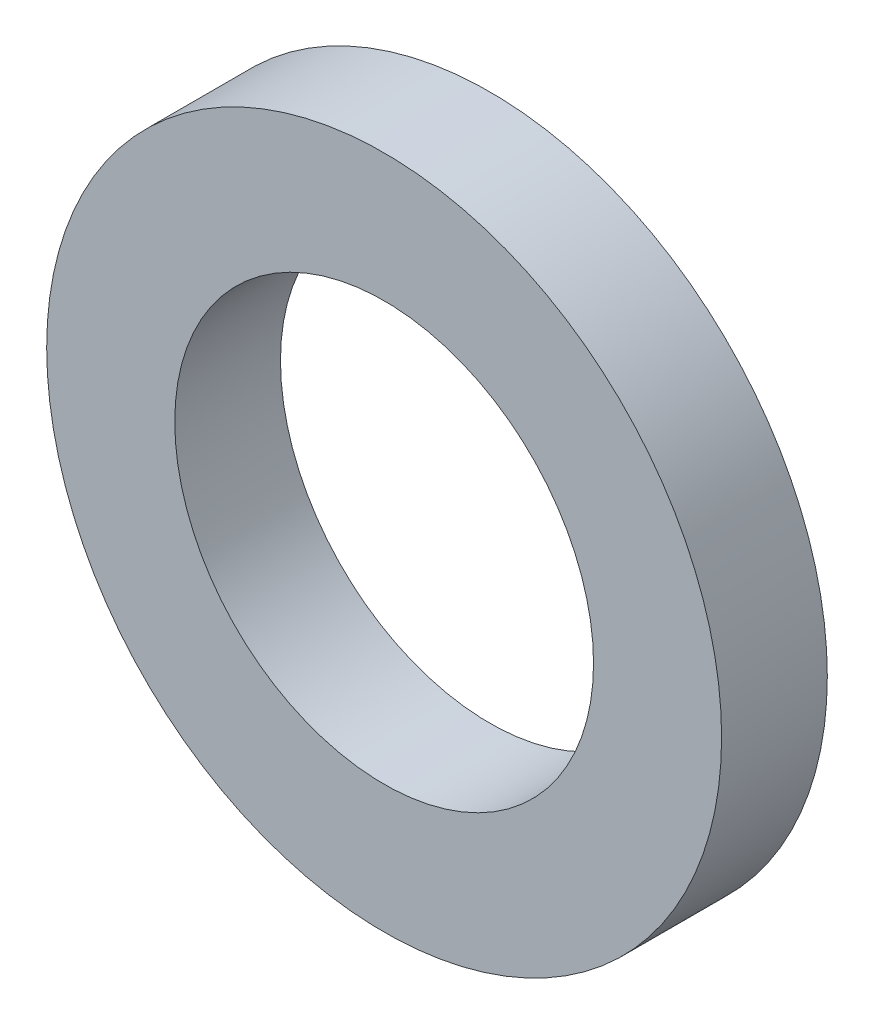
ISO-10303-21;
HEADER;
FILE_DESCRIPTION(('STEP AP214'),'2;1');
FILE_NAME('part.step','',(''),(''),'','','');
FILE_SCHEMA(('AUTOMOTIVE_DESIGN { 1 0 10303 214 1 1 1 1 }'));
ENDSEC;
DATA;
#1=APPLICATION_CONTEXT('core data for automotive mechanical design processes');
#2=APPLICATION_PROTOCOL_DEFINITION('international standard','automotive_design',2000,#1);
#3=PRODUCT_CONTEXT('',#1,'mechanical');
#4=PRODUCT('Part','Part','',(#3));
#5=PRODUCT_RELATED_PRODUCT_CATEGORY('part','',(#4));
#6=PRODUCT_DEFINITION_FORMATION('','',#4);
#7=PRODUCT_DEFINITION_CONTEXT('part definition',#1,'design');
#8=PRODUCT_DEFINITION('design','',#6,#7);
#9=PRODUCT_DEFINITION_SHAPE('','',#8);
#10=(LENGTH_UNIT() NAMED_UNIT(*) SI_UNIT(.MILLI.,.METRE.));
#11=(NAMED_UNIT(*) PLANE_ANGLE_UNIT() SI_UNIT($,.RADIAN.));
#12=(NAMED_UNIT(*) SI_UNIT($,.STERADIAN.) SOLID_ANGLE_UNIT());
#13=UNCERTAINTY_MEASURE_WITH_UNIT(LENGTH_MEASURE(1.E-05),#10,'distance_accuracy_value','');
#14=(GEOMETRIC_REPRESENTATION_CONTEXT(3) GLOBAL_UNCERTAINTY_ASSIGNED_CONTEXT((#13)) GLOBAL_UNIT_ASSIGNED_CONTEXT((#10,
#11,#12)) REPRESENTATION_CONTEXT('',''));
#15=CARTESIAN_POINT('',(0.,0.,0.));
#16=DIRECTION('',(0.,0.,1.));
#17=DIRECTION('',(1.,0.,0.));
#18=AXIS2_PLACEMENT_3D('',#15,#16,#17);
#19=CARTESIAN_POINT('',(0.,0.,2.6));
#20=DIRECTION('',(0.,0.,1.));
#21=DIRECTION('',(1.,0.,0.));
#22=AXIS2_PLACEMENT_3D('',#19,#20,#21);
#23=PLANE('',#22);
#24=CARTESIAN_POINT('',(0.,0.,2.6));
#25=DIRECTION('',(0.,0.,1.));
#26=DIRECTION('',(1.,0.,0.));
#27=AXIS2_PLACEMENT_3D('',#24,#25,#26);
#28=CIRCLE('',#27,8.3);
#29=CARTESIAN_POINT('',(8.3,0.,2.6));
#30=VERTEX_POINT('',#29);
#31=EDGE_CURVE('E10',#30,#30,#28,.T.);
#32=ORIENTED_EDGE('',*,*,#31,.T.);
#33=EDGE_LOOP('',(#32));
#34=FACE_BOUND('',#33,.T.);
#35=CARTESIAN_POINT('',(0.,0.,2.6));
#36=DIRECTION('',(0.,0.,1.));
#37=DIRECTION('',(1.,0.,0.));
#38=AXIS2_PLACEMENT_3D('',#35,#36,#37);
#39=CIRCLE('',#38,5.15);
#40=CARTESIAN_POINT('',(5.15,0.,2.6));
#41=VERTEX_POINT('',#40);
#42=EDGE_CURVE('E44',#41,#41,#39,.T.);
#43=ORIENTED_EDGE('',*,*,#42,.F.);
#44=EDGE_LOOP('',(#43));
#45=FACE_BOUND('',#44,.T.);
#46=ADVANCED_FACE('F33',(#34,#45),#23,.T.);
#47=CARTESIAN_POINT('',(0.,0.,0.));
#48=DIRECTION('',(0.,0.,1.));
#49=DIRECTION('',(1.,0.,0.));
#50=AXIS2_PLACEMENT_3D('',#47,#48,#49);
#51=PLANE('',#50);
#52=CARTESIAN_POINT('',(0.,0.,0.));
#53=DIRECTION('',(0.,0.,1.));
#54=DIRECTION('',(1.,0.,0.));
#55=AXIS2_PLACEMENT_3D('',#52,#53,#54);
#56=CIRCLE('',#55,8.3);
#57=CARTESIAN_POINT('',(8.3,0.,0.));
#58=VERTEX_POINT('',#57);
#59=EDGE_CURVE('E40',#58,#58,#56,.T.);
#60=ORIENTED_EDGE('',*,*,#59,.F.);
#61=EDGE_LOOP('',(#60));
#62=FACE_BOUND('',#61,.T.);
#63=CARTESIAN_POINT('',(0.,0.,0.));
#64=DIRECTION('',(0.,0.,1.));
#65=DIRECTION('',(1.,0.,0.));
#66=AXIS2_PLACEMENT_3D('',#63,#64,#65);
#67=CIRCLE('',#66,5.15);
#68=CARTESIAN_POINT('',(5.15,0.,0.));
#69=VERTEX_POINT('',#68);
#70=EDGE_CURVE('E48',#69,#69,#67,.T.);
#71=ORIENTED_EDGE('',*,*,#70,.T.);
#72=EDGE_LOOP('',(#71));
#73=FACE_BOUND('',#72,.T.);
#74=ADVANCED_FACE('F54',(#62,#73),#51,.F.);
#75=CARTESIAN_POINT('',(0.,0.,2.6));
#76=DIRECTION('',(0.,0.,-1.));
#77=DIRECTION('',(-1.,0.,0.));
#78=AXIS2_PLACEMENT_3D('',#75,#76,#77);
#79=CYLINDRICAL_SURFACE('',#78,8.3);
#80=ORIENTED_EDGE('',*,*,#31,.F.);
#81=EDGE_LOOP('',(#80));
#82=FACE_BOUND('',#81,.T.);
#83=ORIENTED_EDGE('',*,*,#59,.T.);
#84=EDGE_LOOP('',(#83));
#85=FACE_BOUND('',#84,.T.);
#86=ADVANCED_FACE('F35',(#82,#85),#79,.T.);
#87=CARTESIAN_POINT('',(0.,0.,2.6));
#88=DIRECTION('',(0.,0.,-1.));
#89=DIRECTION('',(-1.,0.,0.));
#90=AXIS2_PLACEMENT_3D('',#87,#88,#89);
#91=CYLINDRICAL_SURFACE('',#90,5.15);
#92=ORIENTED_EDGE('',*,*,#42,.T.);
#93=EDGE_LOOP('',(#92));
#94=FACE_BOUND('',#93,.T.);
#95=ORIENTED_EDGE('',*,*,#70,.F.);
#96=EDGE_LOOP('',(#95));
#97=FACE_BOUND('',#96,.T.);
#98=ADVANCED_FACE('F56',(#94,#97),#91,.F.);
#99=CLOSED_SHELL('',(#46,#74,#86,#98));
#100=MANIFOLD_SOLID_BREP('B2',#99);
#101=ADVANCED_BREP_SHAPE_REPRESENTATION('',(#18,#100),#14);
#102=SHAPE_DEFINITION_REPRESENTATION(#9,#101);
ENDSEC;
END-ISO-10303-21;
